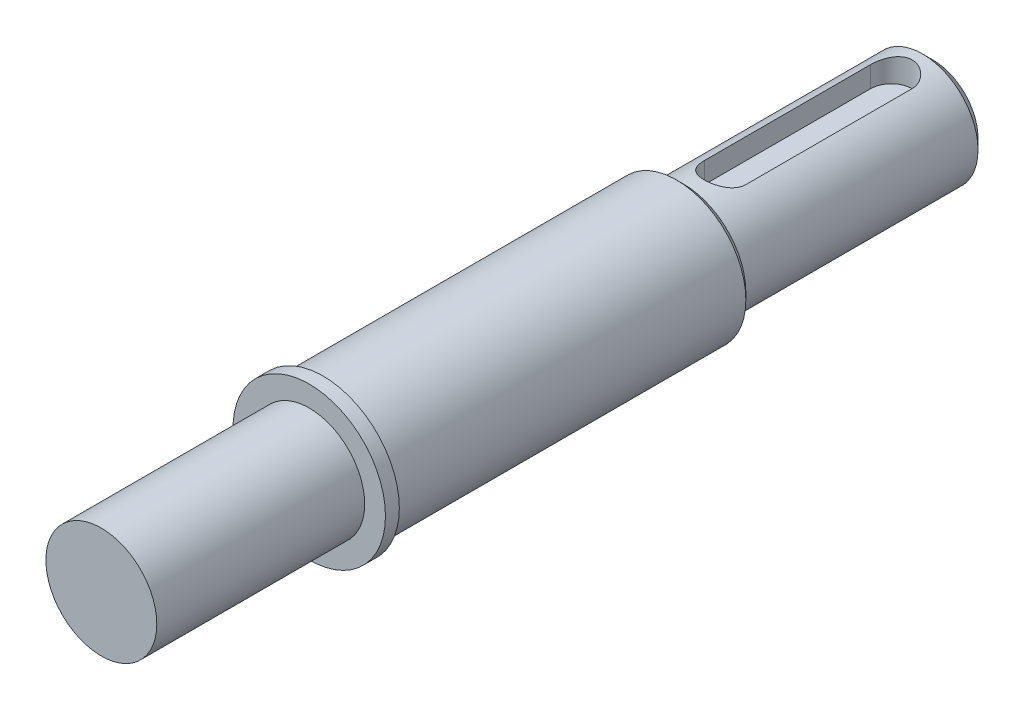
from build123d import *

# Parameters (mm, degrees)
ESQUISSE1_R             = 4
EXTRUSION1_DEPTH        = 60
ENL_V_MAT_EXTRU_1_DEPTH = 61.451964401
CHANFREIN1_SIZE         = 0.75
ESQUISSE3_OUTSIDE_W     = 22.212
ESQUISSE3_OUTSIDE_H     = 22.212
ESQUISSE3_OUTSIDE_R     = 3
ENL_V_MAT_EXTRU_2_DEPTH = 15
ESQUISSE7_R             = 5.5
EXTRUSION4_DEPTH        = 1
ESQUISSE8_R             = 5
EXTRUSION5_DEPTH        = 26
CHANFREIN2_SIZE         = 0.5
EXTRUSION6_START        = -15
ESQUISSE9_R             = 4
EXTRUSION6_DEPTH        = 15


with BuildPart() as part:
    # Esquisse1 → Extrusion1 (new body)
    with BuildSketch(Plane.XY):
        Circle(ESQUISSE1_R)
    extrude(amount=EXTRUSION1_DEPTH)

    # Esquisse2 → Enl_v. mat.-Extru.1 (cut, through all)
    with BuildSketch(Plane(origin=(0, 2.2, 0), x_dir=(1, 0, 0), z_dir=(0, 1, 0))):
        with BuildLine():
            Line((-1.5, -3), (-1.5, -15))
            ThreePointArc((-1.5, -15), (0, -16.5), (1.5, -15))
            Line((1.5, -15), (1.5, -3))
            ThreePointArc((1.5, -3), (0, -1.5), (-1.5, -3))
        make_face()
    extrude(amount=ENL_V_MAT_EXTRU_1_DEPTH, mode=Mode.SUBTRACT)

    # Chanfrein1
    chanfrein1_edges = [part.edges().sort_by_distance(p)[0] for p in [
        (-4, 0, 0),
    ]]
    chamfer(chanfrein1_edges, length=CHANFREIN1_SIZE)

    # Esquisse3 outside → Enl_v. mat.-Extru.2 (cut)
    with BuildSketch(Plane.XY.offset(60)):
        Rectangle(ESQUISSE3_OUTSIDE_W, ESQUISSE3_OUTSIDE_H)
        Circle(ESQUISSE3_OUTSIDE_R, mode=Mode.SUBTRACT)
    extrude(amount=-ENL_V_MAT_EXTRU_2_DEPTH, mode=Mode.SUBTRACT)

    # Esquisse7 → Extrusion4 (add)
    with BuildSketch(Plane.XY.offset(45)):
        Circle(ESQUISSE7_R)
    extrude(amount=-EXTRUSION4_DEPTH)

    # Esquisse8 → Extrusion5 (add)
    with BuildSketch(Plane(origin=(0, 0, 44), x_dir=(-1, 0, 0), z_dir=(0, 0, -1))):
        with Locations(Location((0, 0, 0), (0, 0, 180))):
            Circle(ESQUISSE8_R)
    extrude(amount=EXTRUSION5_DEPTH)

    # Chanfrein2
    chanfrein2_edges = [part.edges().sort_by_distance(p)[0] for p in [
        (-5, 0, 18),
    ]]
    chamfer(chanfrein2_edges, length=CHANFREIN2_SIZE)

    # Esquisse9 → Extrusion6 (add)
    with BuildSketch(Plane.XY.offset(60).offset(EXTRUSION6_START)):
        with Locations(Location((0, 0, 0), (0, 0, 180))):
            Circle(ESQUISSE9_R)
    extrude(amount=EXTRUSION6_DEPTH)


solid = part.part
